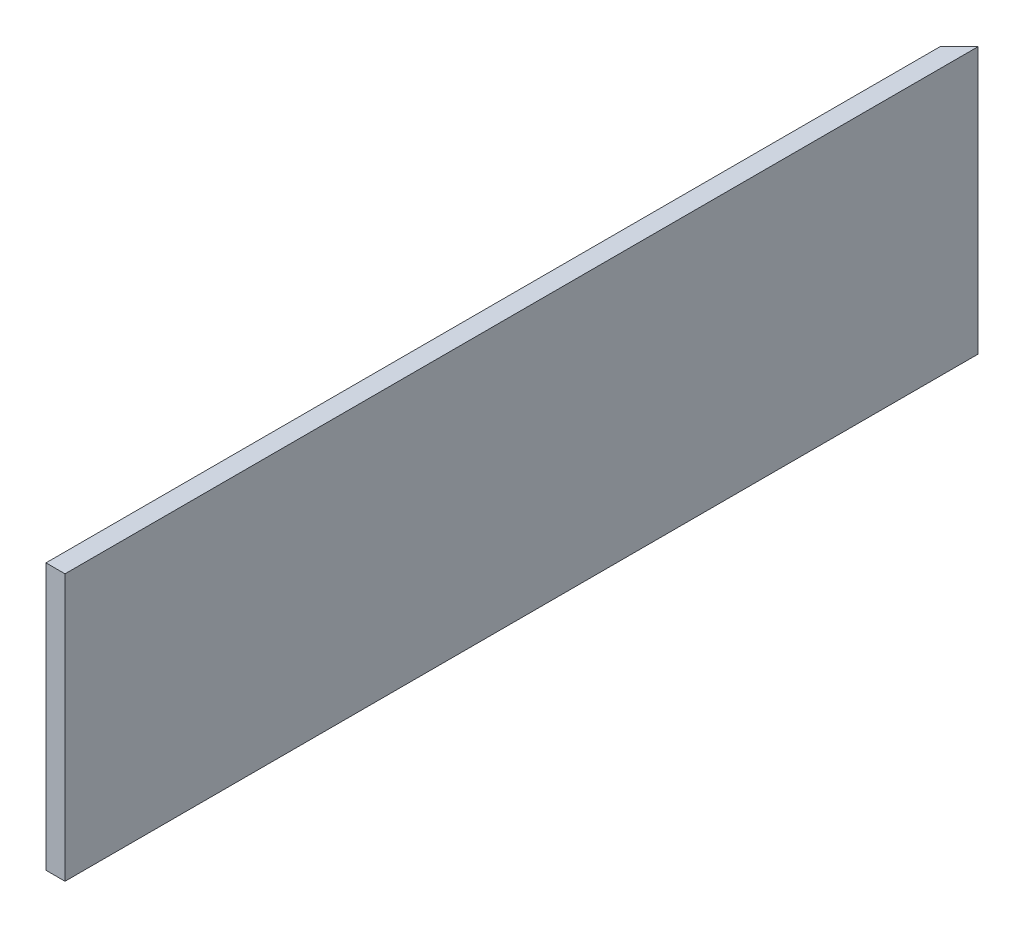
ISO-10303-21;
HEADER;
FILE_DESCRIPTION(('STEP AP214'),'2;1');
FILE_NAME('part.step','',(''),(''),'','','');
FILE_SCHEMA(('AUTOMOTIVE_DESIGN { 1 0 10303 214 1 1 1 1 }'));
ENDSEC;
DATA;
#1=APPLICATION_CONTEXT('core data for automotive mechanical design processes');
#2=APPLICATION_PROTOCOL_DEFINITION('international standard','automotive_design',2000,#1);
#3=PRODUCT_CONTEXT('',#1,'mechanical');
#4=PRODUCT('Part','Part','',(#3));
#5=PRODUCT_RELATED_PRODUCT_CATEGORY('part','',(#4));
#6=PRODUCT_DEFINITION_FORMATION('','',#4);
#7=PRODUCT_DEFINITION_CONTEXT('part definition',#1,'design');
#8=PRODUCT_DEFINITION('design','',#6,#7);
#9=PRODUCT_DEFINITION_SHAPE('','',#8);
#10=(LENGTH_UNIT() NAMED_UNIT(*) SI_UNIT(.MILLI.,.METRE.));
#11=(NAMED_UNIT(*) PLANE_ANGLE_UNIT() SI_UNIT($,.RADIAN.));
#12=(NAMED_UNIT(*) SI_UNIT($,.STERADIAN.) SOLID_ANGLE_UNIT());
#13=UNCERTAINTY_MEASURE_WITH_UNIT(LENGTH_MEASURE(1.E-05),#10,'distance_accuracy_value','');
#14=(GEOMETRIC_REPRESENTATION_CONTEXT(3) GLOBAL_UNCERTAINTY_ASSIGNED_CONTEXT((#13)) GLOBAL_UNIT_ASSIGNED_CONTEXT((#10,
#11,#12)) REPRESENTATION_CONTEXT('',''));
#15=CARTESIAN_POINT('',(0.,0.,0.));
#16=DIRECTION('',(0.,0.,1.));
#17=DIRECTION('',(1.,0.,0.));
#18=AXIS2_PLACEMENT_3D('',#15,#16,#17);
#19=CARTESIAN_POINT('',(0.,355.6,0.));
#20=DIRECTION('',(1.,0.,0.));
#21=DIRECTION('',(0.,0.,-1.));
#22=AXIS2_PLACEMENT_3D('',#19,#20,#21);
#23=PLANE('',#22);
#24=DIRECTION('',(0.,0.,1.));
#25=VECTOR('',#24,1.);
#26=CARTESIAN_POINT('',(0.,0.,0.));
#27=LINE('',#26,#25);
#28=CARTESIAN_POINT('',(0.,0.,-1193.8));
#29=VERTEX_POINT('',#28);
#30=CARTESIAN_POINT('',(0.,0.,0.));
#31=VERTEX_POINT('',#30);
#32=EDGE_CURVE('E102',#29,#31,#27,.T.);
#33=ORIENTED_EDGE('',*,*,#32,.T.);
#34=DIRECTION('',(0.,-1.,0.));
#35=VECTOR('',#34,1.);
#36=CARTESIAN_POINT('',(0.,355.6,0.));
#37=LINE('',#36,#35);
#38=CARTESIAN_POINT('',(0.,355.6,0.));
#39=VERTEX_POINT('',#38);
#40=EDGE_CURVE('E11',#39,#31,#37,.T.);
#41=ORIENTED_EDGE('',*,*,#40,.F.);
#42=DIRECTION('',(0.,0.,1.));
#43=VECTOR('',#42,1.);
#44=CARTESIAN_POINT('',(0.,355.6,0.));
#45=LINE('',#44,#43);
#46=CARTESIAN_POINT('',(0.,355.6,-1193.8));
#47=VERTEX_POINT('',#46);
#48=EDGE_CURVE('E89',#47,#39,#45,.T.);
#49=ORIENTED_EDGE('',*,*,#48,.F.);
#50=DIRECTION('',(0.,-1.,0.));
#51=VECTOR('',#50,1.);
#52=CARTESIAN_POINT('',(0.,355.6,-1193.8));
#53=LINE('',#52,#51);
#54=EDGE_CURVE('E98',#47,#29,#53,.T.);
#55=ORIENTED_EDGE('',*,*,#54,.T.);
#56=EDGE_LOOP('',(#33,#41,#49,#55));
#57=FACE_BOUND('',#56,.T.);
#58=ADVANCED_FACE('F39',(#57),#23,.F.);
#59=CARTESIAN_POINT('',(0.,355.6,0.));
#60=DIRECTION('',(0.,0.,-1.));
#61=DIRECTION('',(-1.,0.,0.));
#62=AXIS2_PLACEMENT_3D('',#59,#60,#61);
#63=PLANE('',#62);
#64=DIRECTION('',(1.,0.,0.));
#65=VECTOR('',#64,1.);
#66=CARTESIAN_POINT('',(0.,0.,0.));
#67=LINE('',#66,#65);
#68=CARTESIAN_POINT('',(25.4,0.,0.));
#69=VERTEX_POINT('',#68);
#70=EDGE_CURVE('E94',#31,#69,#67,.T.);
#71=ORIENTED_EDGE('',*,*,#70,.T.);
#72=DIRECTION('',(0.,-1.,0.));
#73=VECTOR('',#72,1.);
#74=CARTESIAN_POINT('',(25.4,355.6,0.));
#75=LINE('',#74,#73);
#76=CARTESIAN_POINT('',(25.4,355.6,0.));
#77=VERTEX_POINT('',#76);
#78=EDGE_CURVE('E47',#77,#69,#75,.T.);
#79=ORIENTED_EDGE('',*,*,#78,.F.);
#80=DIRECTION('',(1.,0.,0.));
#81=VECTOR('',#80,1.);
#82=CARTESIAN_POINT('',(0.,355.6,0.));
#83=LINE('',#82,#81);
#84=EDGE_CURVE('E84',#39,#77,#83,.T.);
#85=ORIENTED_EDGE('',*,*,#84,.F.);
#86=ORIENTED_EDGE('',*,*,#40,.T.);
#87=EDGE_LOOP('',(#71,#79,#85,#86));
#88=FACE_BOUND('',#87,.T.);
#89=ADVANCED_FACE('F93',(#88),#63,.F.);
#90=CARTESIAN_POINT('',(25.4,355.6,-1219.2));
#91=DIRECTION('',(-1.,0.,0.));
#92=DIRECTION('',(0.,0.,1.));
#93=AXIS2_PLACEMENT_3D('',#90,#91,#92);
#94=PLANE('',#93);
#95=DIRECTION('',(0.,0.,-1.));
#96=VECTOR('',#95,1.);
#97=CARTESIAN_POINT('',(25.4,0.,-1219.2));
#98=LINE('',#97,#96);
#99=CARTESIAN_POINT('',(25.4,0.,-1219.2));
#100=VERTEX_POINT('',#99);
#101=EDGE_CURVE('E71',#69,#100,#98,.T.);
#102=ORIENTED_EDGE('',*,*,#101,.T.);
#103=DIRECTION('',(0.,-1.,0.));
#104=VECTOR('',#103,1.);
#105=CARTESIAN_POINT('',(25.4,355.6,-1219.2));
#106=LINE('',#105,#104);
#107=CARTESIAN_POINT('',(25.4,355.6,-1219.2));
#108=VERTEX_POINT('',#107);
#109=EDGE_CURVE('E95',#108,#100,#106,.T.);
#110=ORIENTED_EDGE('',*,*,#109,.F.);
#111=DIRECTION('',(0.,0.,-1.));
#112=VECTOR('',#111,1.);
#113=CARTESIAN_POINT('',(25.4,355.6,0.));
#114=LINE('',#113,#112);
#115=EDGE_CURVE('E87',#77,#108,#114,.T.);
#116=ORIENTED_EDGE('',*,*,#115,.F.);
#117=ORIENTED_EDGE('',*,*,#78,.T.);
#118=EDGE_LOOP('',(#102,#110,#116,#117));
#119=FACE_BOUND('',#118,.T.);
#120=ADVANCED_FACE('F96',(#119),#94,.F.);
#121=CARTESIAN_POINT('',(0.,355.6,-1193.8));
#122=DIRECTION('',(0.707106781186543,0.,0.707106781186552));
#123=DIRECTION('',(0.707106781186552,0.,-0.707106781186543));
#124=AXIS2_PLACEMENT_3D('',#121,#122,#123);
#125=PLANE('',#124);
#126=DIRECTION('',(-0.707106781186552,0.,0.707106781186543));
#127=VECTOR('',#126,1.);
#128=CARTESIAN_POINT('',(0.,0.,-1193.8));
#129=LINE('',#128,#127);
#130=EDGE_CURVE('E77',#100,#29,#129,.T.);
#131=ORIENTED_EDGE('',*,*,#130,.T.);
#132=ORIENTED_EDGE('',*,*,#54,.F.);
#133=DIRECTION('',(-0.707106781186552,0.,0.707106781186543));
#134=VECTOR('',#133,1.);
#135=CARTESIAN_POINT('',(0.,355.6,-1193.8));
#136=LINE('',#135,#134);
#137=EDGE_CURVE('E55',#108,#47,#136,.T.);
#138=ORIENTED_EDGE('',*,*,#137,.F.);
#139=ORIENTED_EDGE('',*,*,#109,.T.);
#140=EDGE_LOOP('',(#131,#132,#138,#139));
#141=FACE_BOUND('',#140,.T.);
#142=ADVANCED_FACE('F109',(#141),#125,.F.);
#143=CARTESIAN_POINT('',(0.,355.6,0.));
#144=DIRECTION('',(0.,-1.,0.));
#145=DIRECTION('',(0.,0.,-1.));
#146=AXIS2_PLACEMENT_3D('',#143,#144,#145);
#147=PLANE('',#146);
#148=ORIENTED_EDGE('',*,*,#48,.T.);
#149=ORIENTED_EDGE('',*,*,#84,.T.);
#150=ORIENTED_EDGE('',*,*,#115,.T.);
#151=ORIENTED_EDGE('',*,*,#137,.T.);
#152=EDGE_LOOP('',(#148,#149,#150,#151));
#153=FACE_BOUND('',#152,.T.);
#154=ADVANCED_FACE('F85',(#153),#147,.F.);
#155=CARTESIAN_POINT('',(0.,0.,0.));
#156=DIRECTION('',(0.,-1.,0.));
#157=DIRECTION('',(0.,0.,-1.));
#158=AXIS2_PLACEMENT_3D('',#155,#156,#157);
#159=PLANE('',#158);
#160=ORIENTED_EDGE('',*,*,#32,.F.);
#161=ORIENTED_EDGE('',*,*,#130,.F.);
#162=ORIENTED_EDGE('',*,*,#101,.F.);
#163=ORIENTED_EDGE('',*,*,#70,.F.);
#164=EDGE_LOOP('',(#160,#161,#162,#163));
#165=FACE_BOUND('',#164,.T.);
#166=ADVANCED_FACE('F112',(#165),#159,.T.);
#167=CLOSED_SHELL('',(#58,#89,#120,#142,#154,#166));
#168=MANIFOLD_SOLID_BREP('B2',#167);
#169=ADVANCED_BREP_SHAPE_REPRESENTATION('',(#18,#168),#14);
#170=SHAPE_DEFINITION_REPRESENTATION(#9,#169);
ENDSEC;
END-ISO-10303-21;
